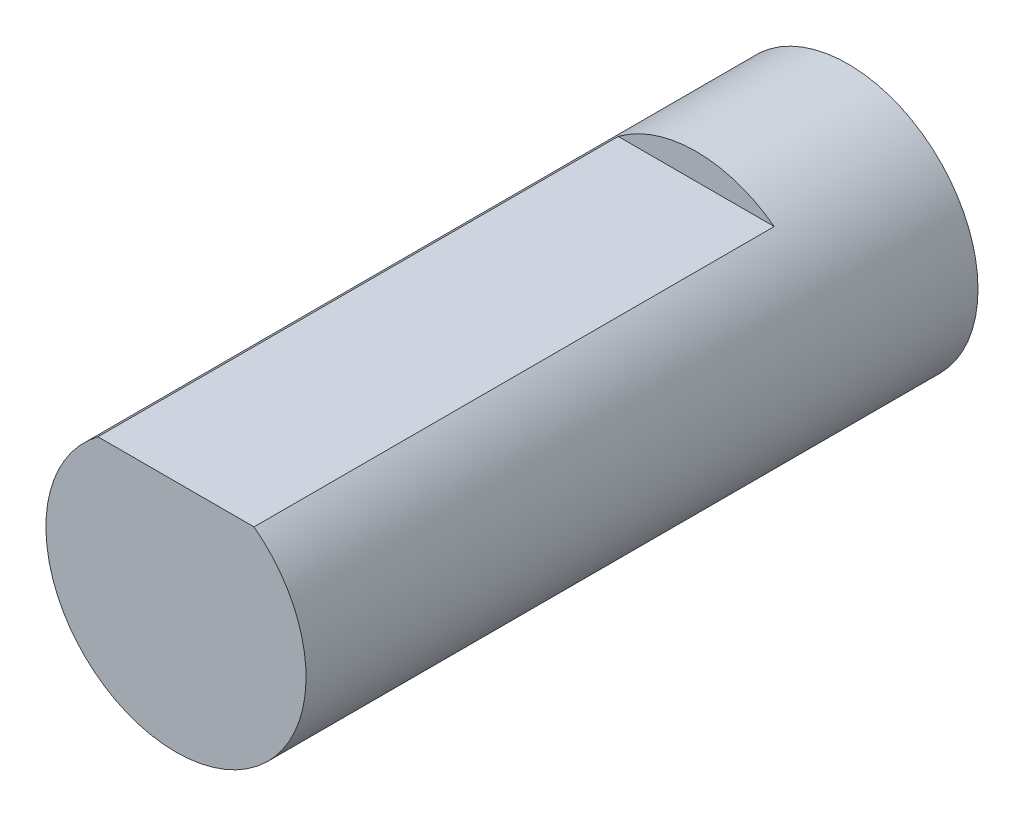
ISO-10303-21;
HEADER;
FILE_DESCRIPTION(('STEP AP214'),'2;1');
FILE_NAME('part.step','',(''),(''),'','','');
FILE_SCHEMA(('AUTOMOTIVE_DESIGN { 1 0 10303 214 1 1 1 1 }'));
ENDSEC;
DATA;
#1=APPLICATION_CONTEXT('core data for automotive mechanical design processes');
#2=APPLICATION_PROTOCOL_DEFINITION('international standard','automotive_design',2000,#1);
#3=PRODUCT_CONTEXT('',#1,'mechanical');
#4=PRODUCT('Part','Part','',(#3));
#5=PRODUCT_RELATED_PRODUCT_CATEGORY('part','',(#4));
#6=PRODUCT_DEFINITION_FORMATION('','',#4);
#7=PRODUCT_DEFINITION_CONTEXT('part definition',#1,'design');
#8=PRODUCT_DEFINITION('design','',#6,#7);
#9=PRODUCT_DEFINITION_SHAPE('','',#8);
#10=(LENGTH_UNIT() NAMED_UNIT(*) SI_UNIT(.MILLI.,.METRE.));
#11=(NAMED_UNIT(*) PLANE_ANGLE_UNIT() SI_UNIT($,.RADIAN.));
#12=(NAMED_UNIT(*) SI_UNIT($,.STERADIAN.) SOLID_ANGLE_UNIT());
#13=UNCERTAINTY_MEASURE_WITH_UNIT(LENGTH_MEASURE(1.E-05),#10,'distance_accuracy_value','');
#14=(GEOMETRIC_REPRESENTATION_CONTEXT(3) GLOBAL_UNCERTAINTY_ASSIGNED_CONTEXT((#13)) GLOBAL_UNIT_ASSIGNED_CONTEXT((#10,
#11,#12)) REPRESENTATION_CONTEXT('',''));
#15=CARTESIAN_POINT('',(0.,0.,0.));
#16=DIRECTION('',(0.,0.,1.));
#17=DIRECTION('',(1.,0.,0.));
#18=AXIS2_PLACEMENT_3D('',#15,#16,#17);
#19=CARTESIAN_POINT('',(0.,0.,15.5));
#20=DIRECTION('',(0.,0.,-1.));
#21=DIRECTION('',(-1.,0.,0.));
#22=AXIS2_PLACEMENT_3D('',#19,#20,#21);
#23=CYLINDRICAL_SURFACE('',#22,3.);
#24=CARTESIAN_POINT('',(0.,0.,15.5));
#25=DIRECTION('',(0.,0.,1.));
#26=DIRECTION('',(1.,0.,0.));
#27=AXIS2_PLACEMENT_3D('',#24,#25,#26);
#28=CIRCLE('',#27,3.);
#29=CARTESIAN_POINT('',(-1.8,2.4,15.5));
#30=VERTEX_POINT('',#29);
#31=CARTESIAN_POINT('',(1.8,2.4,15.5));
#32=VERTEX_POINT('',#31);
#33=EDGE_CURVE('E11',#30,#32,#28,.T.);
#34=ORIENTED_EDGE('',*,*,#33,.F.);
#35=DIRECTION('',(0.,0.,1.));
#36=VECTOR('',#35,1.);
#37=CARTESIAN_POINT('',(-1.8,2.4,3.5));
#38=LINE('',#37,#36);
#39=CARTESIAN_POINT('',(-1.8,2.4,3.5));
#40=VERTEX_POINT('',#39);
#41=EDGE_CURVE('E60',#40,#30,#38,.T.);
#42=ORIENTED_EDGE('',*,*,#41,.F.);
#43=CARTESIAN_POINT('',(0.,0.,3.5));
#44=DIRECTION('',(0.,0.,1.));
#45=DIRECTION('',(1.,0.,0.));
#46=AXIS2_PLACEMENT_3D('',#43,#44,#45);
#47=CIRCLE('',#46,3.);
#48=CARTESIAN_POINT('',(1.8,2.4,3.5));
#49=VERTEX_POINT('',#48);
#50=EDGE_CURVE('E76',#49,#40,#47,.T.);
#51=ORIENTED_EDGE('',*,*,#50,.F.);
#52=DIRECTION('',(0.,0.,1.));
#53=VECTOR('',#52,1.);
#54=CARTESIAN_POINT('',(1.8,2.4,3.5));
#55=LINE('',#54,#53);
#56=EDGE_CURVE('E66',#49,#32,#55,.T.);
#57=ORIENTED_EDGE('',*,*,#56,.T.);
#58=EDGE_LOOP('',(#34,#42,#51,#57));
#59=FACE_BOUND('',#58,.T.);
#60=CARTESIAN_POINT('',(0.,0.,0.));
#61=DIRECTION('',(0.,0.,1.));
#62=DIRECTION('',(1.,0.,0.));
#63=AXIS2_PLACEMENT_3D('',#60,#61,#62);
#64=CIRCLE('',#63,3.);
#65=CARTESIAN_POINT('',(3.,0.,0.));
#66=VERTEX_POINT('',#65);
#67=EDGE_CURVE('E48',#66,#66,#64,.T.);
#68=ORIENTED_EDGE('',*,*,#67,.T.);
#69=EDGE_LOOP('',(#68));
#70=FACE_BOUND('',#69,.T.);
#71=ADVANCED_FACE('F45',(#59,#70),#23,.T.);
#72=CARTESIAN_POINT('',(0.,0.,15.5));
#73=DIRECTION('',(0.,0.,1.));
#74=DIRECTION('',(1.,0.,0.));
#75=AXIS2_PLACEMENT_3D('',#72,#73,#74);
#76=PLANE('',#75);
#77=DIRECTION('',(1.,0.,0.));
#78=VECTOR('',#77,1.);
#79=CARTESIAN_POINT('',(-1.8,2.4,15.5));
#80=LINE('',#79,#78);
#81=EDGE_CURVE('E71',#30,#32,#80,.T.);
#82=ORIENTED_EDGE('',*,*,#81,.F.);
#83=ORIENTED_EDGE('',*,*,#33,.T.);
#84=EDGE_LOOP('',(#82,#83));
#85=FACE_BOUND('',#84,.T.);
#86=ADVANCED_FACE('F83',(#85),#76,.T.);
#87=CARTESIAN_POINT('',(0.,0.,0.));
#88=DIRECTION('',(0.,0.,1.));
#89=DIRECTION('',(1.,0.,0.));
#90=AXIS2_PLACEMENT_3D('',#87,#88,#89);
#91=PLANE('',#90);
#92=ORIENTED_EDGE('',*,*,#67,.F.);
#93=EDGE_LOOP('',(#92));
#94=FACE_BOUND('',#93,.T.);
#95=ADVANCED_FACE('F85',(#94),#91,.F.);
#96=CARTESIAN_POINT('',(-1.8,2.4,3.5));
#97=DIRECTION('',(0.,-1.,0.));
#98=DIRECTION('',(0.,0.,-1.));
#99=AXIS2_PLACEMENT_3D('',#96,#97,#98);
#100=PLANE('',#99);
#101=ORIENTED_EDGE('',*,*,#81,.T.);
#102=ORIENTED_EDGE('',*,*,#56,.F.);
#103=DIRECTION('',(1.,0.,0.));
#104=VECTOR('',#103,1.);
#105=CARTESIAN_POINT('',(-1.8,2.4,3.5));
#106=LINE('',#105,#104);
#107=EDGE_CURVE('E100',#40,#49,#106,.T.);
#108=ORIENTED_EDGE('',*,*,#107,.F.);
#109=ORIENTED_EDGE('',*,*,#41,.T.);
#110=EDGE_LOOP('',(#101,#102,#108,#109));
#111=FACE_BOUND('',#110,.T.);
#112=ADVANCED_FACE('F72',(#111),#100,.F.);
#113=CARTESIAN_POINT('',(0.,0.,3.5));
#114=DIRECTION('',(0.,0.,1.));
#115=DIRECTION('',(1.,0.,0.));
#116=AXIS2_PLACEMENT_3D('',#113,#114,#115);
#117=PLANE('',#116);
#118=ORIENTED_EDGE('',*,*,#50,.T.);
#119=ORIENTED_EDGE('',*,*,#107,.T.);
#120=EDGE_LOOP('',(#118,#119));
#121=FACE_BOUND('',#120,.T.);
#122=ADVANCED_FACE('F95',(#121),#117,.T.);
#123=CLOSED_SHELL('',(#71,#86,#95,#112,#122));
#124=MANIFOLD_SOLID_BREP('B2',#123);
#125=ADVANCED_BREP_SHAPE_REPRESENTATION('',(#18,#124),#14);
#126=SHAPE_DEFINITION_REPRESENTATION(#9,#125);
ENDSEC;
END-ISO-10303-21;
